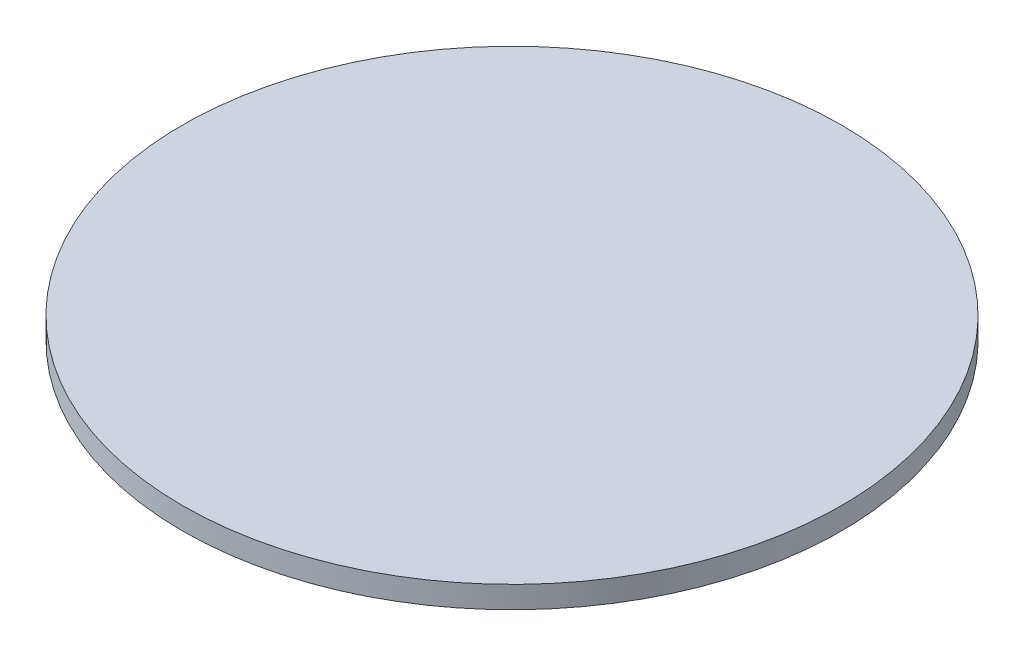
ISO-10303-21;
HEADER;
FILE_DESCRIPTION(('STEP AP214'),'2;1');
FILE_NAME('part.step','',(''),(''),'','','');
FILE_SCHEMA(('AUTOMOTIVE_DESIGN { 1 0 10303 214 1 1 1 1 }'));
ENDSEC;
DATA;
#1=APPLICATION_CONTEXT('core data for automotive mechanical design processes');
#2=APPLICATION_PROTOCOL_DEFINITION('international standard','automotive_design',2000,#1);
#3=PRODUCT_CONTEXT('',#1,'mechanical');
#4=PRODUCT('Part','Part','',(#3));
#5=PRODUCT_RELATED_PRODUCT_CATEGORY('part','',(#4));
#6=PRODUCT_DEFINITION_FORMATION('','',#4);
#7=PRODUCT_DEFINITION_CONTEXT('part definition',#1,'design');
#8=PRODUCT_DEFINITION('design','',#6,#7);
#9=PRODUCT_DEFINITION_SHAPE('','',#8);
#10=(LENGTH_UNIT() NAMED_UNIT(*) SI_UNIT(.MILLI.,.METRE.));
#11=(NAMED_UNIT(*) PLANE_ANGLE_UNIT() SI_UNIT($,.RADIAN.));
#12=(NAMED_UNIT(*) SI_UNIT($,.STERADIAN.) SOLID_ANGLE_UNIT());
#13=UNCERTAINTY_MEASURE_WITH_UNIT(LENGTH_MEASURE(1.E-05),#10,'distance_accuracy_value','');
#14=(GEOMETRIC_REPRESENTATION_CONTEXT(3) GLOBAL_UNCERTAINTY_ASSIGNED_CONTEXT((#13)) GLOBAL_UNIT_ASSIGNED_CONTEXT((#10,
#11,#12)) REPRESENTATION_CONTEXT('',''));
#15=CARTESIAN_POINT('',(0.,0.,0.));
#16=DIRECTION('',(0.,0.,1.));
#17=DIRECTION('',(1.,0.,0.));
#18=AXIS2_PLACEMENT_3D('',#15,#16,#17);
#19=CARTESIAN_POINT('',(0.,15.,0.));
#20=DIRECTION('',(0.,-1.,0.));
#21=DIRECTION('',(0.,0.,-1.));
#22=AXIS2_PLACEMENT_3D('',#19,#20,#21);
#23=CYLINDRICAL_SURFACE('',#22,225.);
#24=CARTESIAN_POINT('',(0.,15.,0.));
#25=DIRECTION('',(0.,1.,0.));
#26=DIRECTION('',(0.,0.,1.));
#27=AXIS2_PLACEMENT_3D('',#24,#25,#26);
#28=CIRCLE('',#27,225.);
#29=CARTESIAN_POINT('',(0.,15.,225.));
#30=VERTEX_POINT('',#29);
#31=EDGE_CURVE('E10',#30,#30,#28,.T.);
#32=ORIENTED_EDGE('',*,*,#31,.F.);
#33=EDGE_LOOP('',(#32));
#34=FACE_BOUND('',#33,.T.);
#35=CARTESIAN_POINT('',(0.,0.,0.));
#36=DIRECTION('',(0.,1.,0.));
#37=DIRECTION('',(0.,0.,1.));
#38=AXIS2_PLACEMENT_3D('',#35,#36,#37);
#39=CIRCLE('',#38,225.);
#40=CARTESIAN_POINT('',(0.,0.,225.));
#41=VERTEX_POINT('',#40);
#42=EDGE_CURVE('E33',#41,#41,#39,.T.);
#43=ORIENTED_EDGE('',*,*,#42,.T.);
#44=EDGE_LOOP('',(#43));
#45=FACE_BOUND('',#44,.T.);
#46=ADVANCED_FACE('F30',(#34,#45),#23,.T.);
#47=CARTESIAN_POINT('',(0.,15.,0.));
#48=DIRECTION('',(0.,1.,0.));
#49=DIRECTION('',(0.,0.,1.));
#50=AXIS2_PLACEMENT_3D('',#47,#48,#49);
#51=PLANE('',#50);
#52=ORIENTED_EDGE('',*,*,#31,.T.);
#53=EDGE_LOOP('',(#52));
#54=FACE_BOUND('',#53,.T.);
#55=ADVANCED_FACE('F45',(#54),#51,.T.);
#56=CARTESIAN_POINT('',(0.,0.,0.));
#57=DIRECTION('',(0.,1.,0.));
#58=DIRECTION('',(0.,0.,1.));
#59=AXIS2_PLACEMENT_3D('',#56,#57,#58);
#60=PLANE('',#59);
#61=ORIENTED_EDGE('',*,*,#42,.F.);
#62=EDGE_LOOP('',(#61));
#63=FACE_BOUND('',#62,.T.);
#64=ADVANCED_FACE('F43',(#63),#60,.F.);
#65=CLOSED_SHELL('',(#46,#55,#64));
#66=MANIFOLD_SOLID_BREP('B2',#65);
#67=ADVANCED_BREP_SHAPE_REPRESENTATION('',(#18,#66),#14);
#68=SHAPE_DEFINITION_REPRESENTATION(#9,#67);
ENDSEC;
END-ISO-10303-21;
